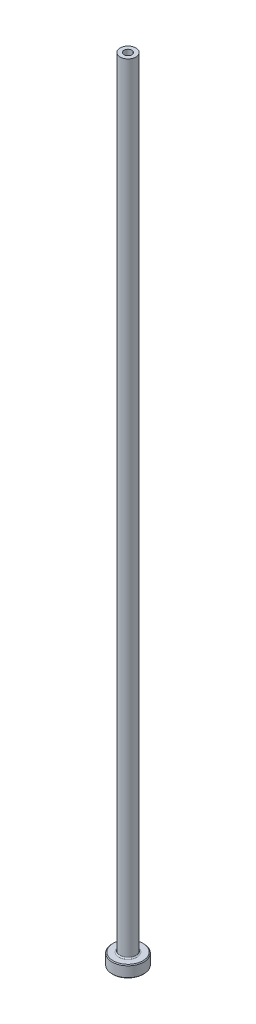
ISO-10303-21;
HEADER;
FILE_DESCRIPTION(('STEP AP214'),'2;1');
FILE_NAME('part.step','',(''),(''),'','','');
FILE_SCHEMA(('AUTOMOTIVE_DESIGN { 1 0 10303 214 1 1 1 1 }'));
ENDSEC;
DATA;
#1=APPLICATION_CONTEXT('core data for automotive mechanical design processes');
#2=APPLICATION_PROTOCOL_DEFINITION('international standard','automotive_design',2000,#1);
#3=PRODUCT_CONTEXT('',#1,'mechanical');
#4=PRODUCT('Part','Part','',(#3));
#5=PRODUCT_RELATED_PRODUCT_CATEGORY('part','',(#4));
#6=PRODUCT_DEFINITION_FORMATION('','',#4);
#7=PRODUCT_DEFINITION_CONTEXT('part definition',#1,'design');
#8=PRODUCT_DEFINITION('design','',#6,#7);
#9=PRODUCT_DEFINITION_SHAPE('','',#8);
#10=(LENGTH_UNIT() NAMED_UNIT(*) SI_UNIT(.MILLI.,.METRE.));
#11=(NAMED_UNIT(*) PLANE_ANGLE_UNIT() SI_UNIT($,.RADIAN.));
#12=(NAMED_UNIT(*) SI_UNIT($,.STERADIAN.) SOLID_ANGLE_UNIT());
#13=UNCERTAINTY_MEASURE_WITH_UNIT(LENGTH_MEASURE(1.E-05),#10,'distance_accuracy_value','');
#14=(GEOMETRIC_REPRESENTATION_CONTEXT(3) GLOBAL_UNCERTAINTY_ASSIGNED_CONTEXT((#13)) GLOBAL_UNIT_ASSIGNED_CONTEXT((#10,
#11,#12)) REPRESENTATION_CONTEXT('',''));
#15=CARTESIAN_POINT('',(0.,0.,0.));
#16=DIRECTION('',(0.,0.,1.));
#17=DIRECTION('',(1.,0.,0.));
#18=AXIS2_PLACEMENT_3D('',#15,#16,#17);
#19=CARTESIAN_POINT('',(0.,92.1876809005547,0.));
#20=DIRECTION('',(0.,1.,0.));
#21=DIRECTION('',(0.,0.,1.));
#22=AXIS2_PLACEMENT_3D('',#19,#20,#21);
#23=CYLINDRICAL_SURFACE('',#22,1.00000000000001);
#24=CARTESIAN_POINT('',(0.,200.,0.));
#25=DIRECTION('',(0.,1.,0.));
#26=DIRECTION('',(0.,0.,1.));
#27=AXIS2_PLACEMENT_3D('',#24,#25,#26);
#28=CIRCLE('',#27,1.00000000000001);
#29=CARTESIAN_POINT('',(0.,200.,1.00000000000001));
#30=VERTEX_POINT('',#29);
#31=EDGE_CURVE('E62',#30,#30,#28,.T.);
#32=ORIENTED_EDGE('',*,*,#31,.T.);
#33=EDGE_LOOP('',(#32));
#34=FACE_BOUND('',#33,.T.);
#35=CARTESIAN_POINT('',(0.,165.,0.));
#36=DIRECTION('',(0.,1.,0.));
#37=DIRECTION('',(0.,0.,1.));
#38=AXIS2_PLACEMENT_3D('',#35,#36,#37);
#39=CIRCLE('',#38,1.00000000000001);
#40=CARTESIAN_POINT('',(0.,165.,1.00000000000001));
#41=VERTEX_POINT('',#40);
#42=EDGE_CURVE('E71',#41,#41,#39,.T.);
#43=ORIENTED_EDGE('',*,*,#42,.F.);
#44=EDGE_LOOP('',(#43));
#45=FACE_BOUND('',#44,.T.);
#46=ADVANCED_FACE('F30',(#34,#45),#23,.F.);
#47=CARTESIAN_POINT('',(-1.00000000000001,200.,0.));
#48=DIRECTION('',(0.,1.,0.));
#49=DIRECTION('',(0.,0.,1.));
#50=AXIS2_PLACEMENT_3D('',#47,#48,#49);
#51=PLANE('',#50);
#52=CARTESIAN_POINT('',(0.,200.,0.));
#53=DIRECTION('',(0.,1.,0.));
#54=DIRECTION('',(0.,0.,1.));
#55=AXIS2_PLACEMENT_3D('',#52,#53,#54);
#56=CIRCLE('',#55,2.00000000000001);
#57=CARTESIAN_POINT('',(0.,200.,2.00000000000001));
#58=VERTEX_POINT('',#57);
#59=EDGE_CURVE('E65',#58,#58,#56,.T.);
#60=ORIENTED_EDGE('',*,*,#59,.T.);
#61=EDGE_LOOP('',(#60));
#62=FACE_BOUND('',#61,.T.);
#63=ORIENTED_EDGE('',*,*,#31,.F.);
#64=EDGE_LOOP('',(#63));
#65=FACE_BOUND('',#64,.T.);
#66=ADVANCED_FACE('F79',(#62,#65),#51,.T.);
#67=CARTESIAN_POINT('',(0.,92.1876809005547,0.));
#68=DIRECTION('',(0.,1.,0.));
#69=DIRECTION('',(0.,0.,1.));
#70=AXIS2_PLACEMENT_3D('',#67,#68,#69);
#71=CYLINDRICAL_SURFACE('',#70,2.);
#72=CARTESIAN_POINT('',(0.,3.3,0.));
#73=DIRECTION('',(0.,1.,0.));
#74=DIRECTION('',(0.,0.,1.));
#75=AXIS2_PLACEMENT_3D('',#72,#73,#74);
#76=CIRCLE('',#75,2.);
#77=CARTESIAN_POINT('',(0.,3.3,2.));
#78=VERTEX_POINT('',#77);
#79=EDGE_CURVE('E59',#78,#78,#76,.T.);
#80=ORIENTED_EDGE('',*,*,#79,.T.);
#81=EDGE_LOOP('',(#80));
#82=FACE_BOUND('',#81,.T.);
#83=ORIENTED_EDGE('',*,*,#59,.F.);
#84=EDGE_LOOP('',(#83));
#85=FACE_BOUND('',#84,.T.);
#86=ADVANCED_FACE('F85',(#82,#85),#71,.T.);
#87=CARTESIAN_POINT('',(-1.99999999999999,3.,0.));
#88=DIRECTION('',(0.,1.,0.));
#89=DIRECTION('',(0.,0.,1.));
#90=AXIS2_PLACEMENT_3D('',#87,#88,#89);
#91=PLANE('',#90);
#92=CARTESIAN_POINT('',(0.,3.,0.));
#93=DIRECTION('',(0.,1.,0.));
#94=DIRECTION('',(0.,0.,1.));
#95=AXIS2_PLACEMENT_3D('',#92,#93,#94);
#96=CIRCLE('',#95,3.8);
#97=CARTESIAN_POINT('',(0.,3.,3.8));
#98=VERTEX_POINT('',#97);
#99=EDGE_CURVE('E53',#98,#98,#96,.T.);
#100=ORIENTED_EDGE('',*,*,#99,.T.);
#101=EDGE_LOOP('',(#100));
#102=FACE_BOUND('',#101,.T.);
#103=CARTESIAN_POINT('',(0.,3.,0.));
#104=DIRECTION('',(0.,1.,0.));
#105=DIRECTION('',(0.,0.,1.));
#106=AXIS2_PLACEMENT_3D('',#103,#104,#105);
#107=CIRCLE('',#106,2.3);
#108=CARTESIAN_POINT('',(0.,3.,2.3));
#109=VERTEX_POINT('',#108);
#110=EDGE_CURVE('E56',#109,#109,#107,.F.);
#111=ORIENTED_EDGE('',*,*,#110,.T.);
#112=EDGE_LOOP('',(#111));
#113=FACE_BOUND('',#112,.T.);
#114=ADVANCED_FACE('F111',(#102,#113),#91,.T.);
#115=CARTESIAN_POINT('',(0.,92.1876809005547,0.));
#116=DIRECTION('',(0.,1.,0.));
#117=DIRECTION('',(0.,0.,1.));
#118=AXIS2_PLACEMENT_3D('',#115,#116,#117);
#119=CYLINDRICAL_SURFACE('',#118,3.99999999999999);
#120=CARTESIAN_POINT('',(0.,2.79999999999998,0.));
#121=DIRECTION('',(0.,1.,0.));
#122=DIRECTION('',(0.,0.,1.));
#123=AXIS2_PLACEMENT_3D('',#120,#121,#122);
#124=CIRCLE('',#123,3.99999999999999);
#125=CARTESIAN_POINT('',(0.,2.79999999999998,3.99999999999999));
#126=VERTEX_POINT('',#125);
#127=EDGE_CURVE('E45',#126,#126,#124,.F.);
#128=ORIENTED_EDGE('',*,*,#127,.T.);
#129=EDGE_LOOP('',(#128));
#130=FACE_BOUND('',#129,.T.);
#131=CARTESIAN_POINT('',(0.,0.200000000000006,0.));
#132=DIRECTION('',(0.,-1.,0.));
#133=DIRECTION('',(0.,0.,-1.));
#134=AXIS2_PLACEMENT_3D('',#131,#132,#133);
#135=CIRCLE('',#134,3.99999999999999);
#136=CARTESIAN_POINT('',(0.,0.200000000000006,-3.99999999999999));
#137=VERTEX_POINT('',#136);
#138=EDGE_CURVE('E50',#137,#137,#135,.F.);
#139=ORIENTED_EDGE('',*,*,#138,.T.);
#140=EDGE_LOOP('',(#139));
#141=FACE_BOUND('',#140,.T.);
#142=ADVANCED_FACE('F108',(#130,#141),#119,.T.);
#143=CARTESIAN_POINT('',(-3.99999999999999,0.,0.));
#144=DIRECTION('',(0.,-1.,0.));
#145=DIRECTION('',(0.,0.,-1.));
#146=AXIS2_PLACEMENT_3D('',#143,#144,#145);
#147=PLANE('',#146);
#148=CARTESIAN_POINT('',(0.,0.,0.));
#149=DIRECTION('',(0.,-1.,0.));
#150=DIRECTION('',(0.,0.,-1.));
#151=AXIS2_PLACEMENT_3D('',#148,#149,#150);
#152=CIRCLE('',#151,1.75);
#153=CARTESIAN_POINT('',(0.,0.,-1.75));
#154=VERTEX_POINT('',#153);
#155=EDGE_CURVE('E37',#154,#154,#152,.F.);
#156=ORIENTED_EDGE('',*,*,#155,.T.);
#157=EDGE_LOOP('',(#156));
#158=FACE_BOUND('',#157,.T.);
#159=CARTESIAN_POINT('',(0.,0.,0.));
#160=DIRECTION('',(0.,-1.,0.));
#161=DIRECTION('',(0.,0.,-1.));
#162=AXIS2_PLACEMENT_3D('',#159,#160,#161);
#163=CIRCLE('',#162,3.79999999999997);
#164=CARTESIAN_POINT('',(0.,0.,-3.79999999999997));
#165=VERTEX_POINT('',#164);
#166=EDGE_CURVE('E41',#165,#165,#163,.T.);
#167=ORIENTED_EDGE('',*,*,#166,.T.);
#168=EDGE_LOOP('',(#167));
#169=FACE_BOUND('',#168,.T.);
#170=ADVANCED_FACE('F110',(#158,#169),#147,.T.);
#171=CARTESIAN_POINT('',(0.,92.1876809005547,0.));
#172=DIRECTION('',(0.,1.,0.));
#173=DIRECTION('',(0.,0.,1.));
#174=AXIS2_PLACEMENT_3D('',#171,#172,#173);
#175=CYLINDRICAL_SURFACE('',#174,1.25);
#176=CARTESIAN_POINT('',(0.,0.499999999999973,0.));
#177=DIRECTION('',(0.,-1.,0.));
#178=DIRECTION('',(0.,0.,-1.));
#179=AXIS2_PLACEMENT_3D('',#176,#177,#178);
#180=CIRCLE('',#179,1.25);
#181=CARTESIAN_POINT('',(0.,0.499999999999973,-1.25));
#182=VERTEX_POINT('',#181);
#183=EDGE_CURVE('E10',#182,#182,#180,.T.);
#184=ORIENTED_EDGE('',*,*,#183,.T.);
#185=EDGE_LOOP('',(#184));
#186=FACE_BOUND('',#185,.T.);
#187=CARTESIAN_POINT('',(0.,153.,0.));
#188=DIRECTION('',(0.,1.,0.));
#189=DIRECTION('',(0.,0.,1.));
#190=AXIS2_PLACEMENT_3D('',#187,#188,#189);
#191=CIRCLE('',#190,1.25000000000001);
#192=CARTESIAN_POINT('',(0.,153.,1.25000000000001));
#193=VERTEX_POINT('',#192);
#194=EDGE_CURVE('E68',#193,#193,#191,.T.);
#195=ORIENTED_EDGE('',*,*,#194,.T.);
#196=EDGE_LOOP('',(#195));
#197=FACE_BOUND('',#196,.T.);
#198=ADVANCED_FACE('F118',(#186,#197),#175,.F.);
#199=CARTESIAN_POINT('',(0.,153.,0.));
#200=DIRECTION('',(0.,-1.,0.));
#201=DIRECTION('',(0.,0.,-1.));
#202=AXIS2_PLACEMENT_3D('',#199,#200,#201);
#203=CONICAL_SURFACE('',#202,1.25000000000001,0.0208303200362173);
#204=ORIENTED_EDGE('',*,*,#42,.T.);
#205=EDGE_LOOP('',(#204));
#206=FACE_BOUND('',#205,.T.);
#207=ORIENTED_EDGE('',*,*,#194,.F.);
#208=EDGE_LOOP('',(#207));
#209=FACE_BOUND('',#208,.T.);
#210=ADVANCED_FACE('F75',(#206,#209),#203,.F.);
#211=CARTESIAN_POINT('',(0.,3.3,0.));
#212=DIRECTION('',(0.,1.,0.));
#213=DIRECTION('',(0.,0.,1.));
#214=AXIS2_PLACEMENT_3D('',#211,#212,#213);
#215=TOROIDAL_SURFACE('',#214,2.3,0.3);
#216=ORIENTED_EDGE('',*,*,#110,.F.);
#217=EDGE_LOOP('',(#216));
#218=FACE_BOUND('',#217,.T.);
#219=ORIENTED_EDGE('',*,*,#79,.F.);
#220=EDGE_LOOP('',(#219));
#221=FACE_BOUND('',#220,.T.);
#222=ADVANCED_FACE('F90',(#218,#221),#215,.F.);
#223=CARTESIAN_POINT('',(0.,3.,0.));
#224=DIRECTION('',(0.,-1.,0.));
#225=DIRECTION('',(0.,0.,-1.));
#226=AXIS2_PLACEMENT_3D('',#223,#224,#225);
#227=CONICAL_SURFACE('',#226,3.8,0.785398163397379);
#228=ORIENTED_EDGE('',*,*,#127,.F.);
#229=EDGE_LOOP('',(#228));
#230=FACE_BOUND('',#229,.T.);
#231=ORIENTED_EDGE('',*,*,#99,.F.);
#232=EDGE_LOOP('',(#231));
#233=FACE_BOUND('',#232,.T.);
#234=ADVANCED_FACE('F93',(#230,#233),#227,.T.);
#235=CARTESIAN_POINT('',(0.,0.200000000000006,0.));
#236=DIRECTION('',(0.,1.,0.));
#237=DIRECTION('',(0.,0.,1.));
#238=AXIS2_PLACEMENT_3D('',#235,#236,#237);
#239=CONICAL_SURFACE('',#238,3.99999999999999,0.785398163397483);
#240=ORIENTED_EDGE('',*,*,#166,.F.);
#241=EDGE_LOOP('',(#240));
#242=FACE_BOUND('',#241,.T.);
#243=ORIENTED_EDGE('',*,*,#138,.F.);
#244=EDGE_LOOP('',(#243));
#245=FACE_BOUND('',#244,.T.);
#246=ADVANCED_FACE('F96',(#242,#245),#239,.T.);
#247=CARTESIAN_POINT('',(0.,0.,0.));
#248=DIRECTION('',(0.,-1.,0.));
#249=DIRECTION('',(0.,0.,-1.));
#250=AXIS2_PLACEMENT_3D('',#247,#248,#249);
#251=CONICAL_SURFACE('',#250,1.75,0.785398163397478);
#252=ORIENTED_EDGE('',*,*,#183,.F.);
#253=EDGE_LOOP('',(#252));
#254=FACE_BOUND('',#253,.T.);
#255=ORIENTED_EDGE('',*,*,#155,.F.);
#256=EDGE_LOOP('',(#255));
#257=FACE_BOUND('',#256,.T.);
#258=ADVANCED_FACE('F32',(#254,#257),#251,.F.);
#259=CLOSED_SHELL('',(#46,#66,#86,#114,#142,#170,#198,#210,#222,#234,#246,#258));
#260=MANIFOLD_SOLID_BREP('B2',#259);
#261=ADVANCED_BREP_SHAPE_REPRESENTATION('',(#18,#260),#14);
#262=SHAPE_DEFINITION_REPRESENTATION(#9,#261);
ENDSEC;
END-ISO-10303-21;
